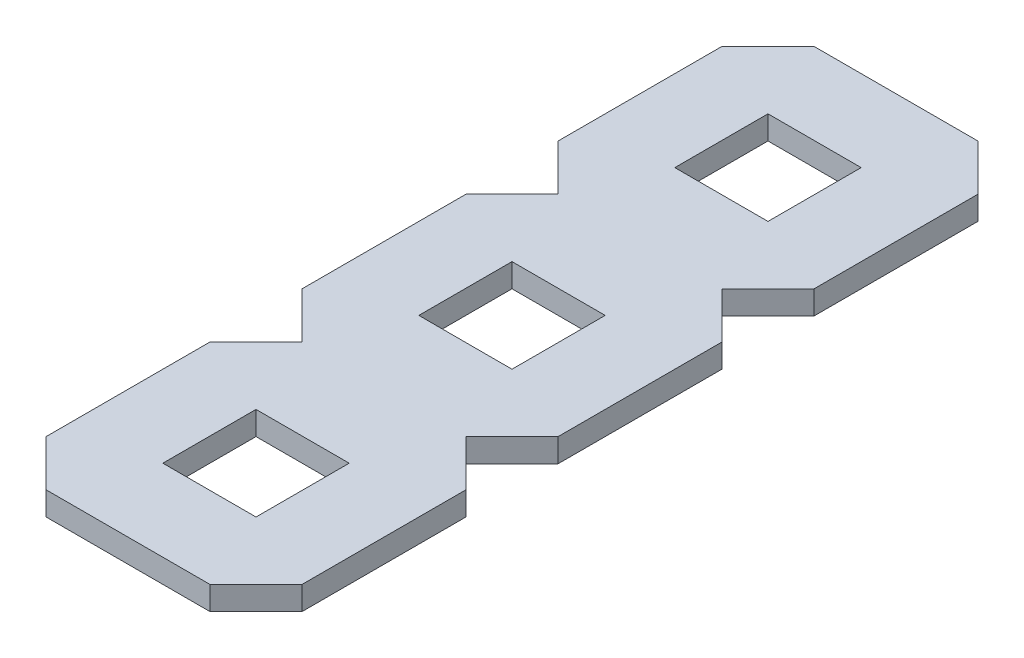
from build123d import *

# Parameters (mm, degrees)
SKETCH1_W           = 4.6228
SKETCH1_H           = 4.6228
BOSS_EXTRUDE1_DEPTH = 1.1684
SKETCH2_W           = 63.5
SKETCH2_H           = 63.5
CUT_EXTRUDE1_DEPTH  = 2.54
CUT_EXTRUDE2_DEPTH  = 13.97


with BuildPart() as part:
    # Sketch1 → Boss-Extrude1 (new body)
    with BuildSketch(Plane(origin=(0, 1.1684, 0), x_dir=(1, 0, 0), z_dir=(0, 1, 0))):
        Polygon((14.980985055, 127), (12.7, 124.719014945), (10.419014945, 127), (2.280985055, 127), (0, 124.719014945), (0, 116.580985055), (2.280985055, 114.3), (0, 112.019014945), (0, 103.880985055), (2.280985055, 101.6), (0, 99.319014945), (0, 91.180985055), (2.280985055, 88.9), (0, 86.619014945), (0, 78.480985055), (2.280985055, 76.2), (0, 73.919014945), (0, 65.780985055), (2.280985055, 63.5), (0, 61.219014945), (0, 53.080985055), (2.280985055, 50.8), (0, 48.519014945), (0, 40.380985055), (2.280985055, 38.1), (0, 35.819014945), (0, 27.680985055), (2.280985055, 25.4), (0, 23.119014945), (0, 14.980985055), (2.280985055, 12.7), (0, 10.419014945), (0, 2.280985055), (2.280985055, 0), (10.419014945, 0), (12.7, 2.280985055), (14.980985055, 0), (23.119014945, 0), (25.4, 2.280985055), (27.680985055, 0), (35.819014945, 0), (38.1, 2.280985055), (40.380985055, 0), (48.519014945, 0), (50.8, 2.280985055), (53.080985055, 0), (61.219014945, 0), (63.5, 2.280985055), (63.5, 10.419014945), (61.219014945, 12.7), (63.5, 14.980985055), (63.5, 23.119014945), (61.219014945, 25.4), (63.5, 27.680985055), (63.5, 35.819014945), (61.219014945, 38.1), (63.5, 40.380985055), (63.5, 48.519014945), (61.219014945, 50.8), (63.5, 53.080985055), (63.5, 61.219014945), (61.219014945, 63.5), (63.5, 65.780985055), (63.5, 73.919014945), (61.219014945, 76.2), (63.5, 78.480985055), (63.5, 86.619014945), (61.219014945, 88.9), (63.5, 91.180985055), (63.5, 99.319014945), (61.219014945, 101.6), (63.5, 103.880985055), (63.5, 112.019014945), (61.219014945, 114.3), (63.5, 116.580985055), (63.5, 124.719014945), (61.219014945, 127), (53.080985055, 127), (50.8, 124.719014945), (48.519014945, 127), (40.380985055, 127), (38.1, 124.719014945), (35.819014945, 127), (27.680985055, 127), (25.4, 124.719014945), (23.119014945, 127), align=None)
        Polygon((12.7, 112.019014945), (10.419014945, 114.3), (12.7, 116.580985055), (14.980985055, 114.3), align=None, mode=Mode.SUBTRACT)
        Polygon((12.7, 86.619014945), (10.419014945, 88.9), (12.7, 91.180985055), (14.980985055, 88.9), align=None, mode=Mode.SUBTRACT)
        Polygon((12.7, 61.219014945), (10.419014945, 63.5), (12.7, 65.780985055), (14.980985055, 63.5), align=None, mode=Mode.SUBTRACT)
        Polygon((12.7, 35.819014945), (10.419014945, 38.1), (12.7, 40.380985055), (14.980985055, 38.1), align=None, mode=Mode.SUBTRACT)
        Polygon((12.7, 10.419014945), (10.419014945, 12.7), (12.7, 14.980985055), (14.980985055, 12.7), align=None, mode=Mode.SUBTRACT)
        Polygon((25.4, 112.019014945), (23.119014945, 114.3), (25.4, 116.580985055), (27.680985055, 114.3), align=None, mode=Mode.SUBTRACT)
        Polygon((25.4, 86.619014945), (23.119014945, 88.9), (25.4, 91.180985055), (27.680985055, 88.9), align=None, mode=Mode.SUBTRACT)
        Polygon((25.4, 61.219014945), (23.119014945, 63.5), (25.4, 65.780985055), (27.680985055, 63.5), align=None, mode=Mode.SUBTRACT)
        Polygon((25.4, 35.819014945), (23.119014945, 38.1), (25.4, 40.380985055), (27.680985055, 38.1), align=None, mode=Mode.SUBTRACT)
        Polygon((25.4, 10.419014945), (23.119014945, 12.7), (25.4, 14.980985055), (27.680985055, 12.7), align=None, mode=Mode.SUBTRACT)
        Polygon((38.1, 112.019014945), (35.819014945, 114.3), (38.1, 116.580985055), (40.380985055, 114.3), align=None, mode=Mode.SUBTRACT)
        Polygon((38.1, 86.619014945), (35.819014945, 88.9), (38.1, 91.180985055), (40.380985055, 88.9), align=None, mode=Mode.SUBTRACT)
        Polygon((38.1, 61.219014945), (35.819014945, 63.5), (38.1, 65.780985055), (40.380985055, 63.5), align=None, mode=Mode.SUBTRACT)
        Polygon((38.1, 35.819014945), (35.819014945, 38.1), (38.1, 40.380985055), (40.380985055, 38.1), align=None, mode=Mode.SUBTRACT)
        Polygon((38.1, 10.419014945), (35.819014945, 12.7), (38.1, 14.980985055), (40.380985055, 12.7), align=None, mode=Mode.SUBTRACT)
        Polygon((50.8, 112.019014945), (48.519014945, 114.3), (50.8, 116.580985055), (53.080985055, 114.3), align=None, mode=Mode.SUBTRACT)
        Polygon((50.8, 86.619014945), (48.519014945, 88.9), (50.8, 91.180985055), (53.080985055, 88.9), align=None, mode=Mode.SUBTRACT)
        Polygon((50.8, 61.219014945), (48.519014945, 63.5), (50.8, 65.780985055), (53.080985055, 63.5), align=None, mode=Mode.SUBTRACT)
        Polygon((50.8, 35.819014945), (48.519014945, 38.1), (50.8, 40.380985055), (53.080985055, 38.1), align=None, mode=Mode.SUBTRACT)
        Polygon((50.8, 10.419014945), (48.519014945, 12.7), (50.8, 14.980985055), (53.080985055, 12.7), align=None, mode=Mode.SUBTRACT)
        with Locations((6.35, 120.65)):
            Rectangle(SKETCH1_W, SKETCH1_H, mode=Mode.SUBTRACT)
        with Locations((19.05, 120.65)):
            Rectangle(SKETCH1_W, SKETCH1_H, mode=Mode.SUBTRACT)
        with Locations((31.75, 120.65)):
            Rectangle(SKETCH1_W, SKETCH1_H, mode=Mode.SUBTRACT)
        with Locations((44.45, 120.65)):
            Rectangle(SKETCH1_W, SKETCH1_H, mode=Mode.SUBTRACT)
        with Locations((57.15, 120.65)):
            Rectangle(SKETCH1_W, SKETCH1_H, mode=Mode.SUBTRACT)
        with Locations((6.35, 107.95)):
            Rectangle(SKETCH1_W, SKETCH1_H, mode=Mode.SUBTRACT)
        with Locations((57.15, 107.95)):
            Rectangle(SKETCH1_W, SKETCH1_H, mode=Mode.SUBTRACT)
        with Locations((6.35, 95.25)):
            Rectangle(SKETCH1_W, SKETCH1_H, mode=Mode.SUBTRACT)
        with Locations((57.15, 95.25)):
            Rectangle(SKETCH1_W, SKETCH1_H, mode=Mode.SUBTRACT)
        with Locations((6.35, 82.55)):
            Rectangle(SKETCH1_W, SKETCH1_H, mode=Mode.SUBTRACT)
        with Locations((57.15, 82.55)):
            Rectangle(SKETCH1_W, SKETCH1_H, mode=Mode.SUBTRACT)
        with Locations((6.35, 69.85)):
            Rectangle(SKETCH1_W, SKETCH1_H, mode=Mode.SUBTRACT)
        with Locations((57.15, 69.85)):
            Rectangle(SKETCH1_W, SKETCH1_H, mode=Mode.SUBTRACT)
        with Locations((6.35, 57.15)):
            Rectangle(SKETCH1_W, SKETCH1_H, mode=Mode.SUBTRACT)
        with Locations((57.15, 57.15)):
            Rectangle(SKETCH1_W, SKETCH1_H, mode=Mode.SUBTRACT)
        with Locations((6.35, 44.45)):
            Rectangle(SKETCH1_W, SKETCH1_H, mode=Mode.SUBTRACT)
        with Locations((57.15, 44.45)):
            Rectangle(SKETCH1_W, SKETCH1_H, mode=Mode.SUBTRACT)
        with Locations((6.35, 31.75)):
            Rectangle(SKETCH1_W, SKETCH1_H, mode=Mode.SUBTRACT)
        with Locations((57.15, 31.75)):
            Rectangle(SKETCH1_W, SKETCH1_H, mode=Mode.SUBTRACT)
        with Locations((6.35, 19.05)):
            Rectangle(SKETCH1_W, SKETCH1_H, mode=Mode.SUBTRACT)
        with Locations((57.15, 19.05)):
            Rectangle(SKETCH1_W, SKETCH1_H, mode=Mode.SUBTRACT)
        with Locations((6.35, 6.35)):
            Rectangle(SKETCH1_W, SKETCH1_H, mode=Mode.SUBTRACT)
        with Locations((19.05, 6.35)):
            Rectangle(SKETCH1_W, SKETCH1_H, mode=Mode.SUBTRACT)
        with Locations((31.75, 6.35)):
            Rectangle(SKETCH1_W, SKETCH1_H, mode=Mode.SUBTRACT)
        with Locations((19.05, 107.95)):
            Rectangle(SKETCH1_W, SKETCH1_H, mode=Mode.SUBTRACT)
        with Locations((31.75, 107.95)):
            Rectangle(SKETCH1_W, SKETCH1_H, mode=Mode.SUBTRACT)
        with Locations((44.45, 107.95)):
            Rectangle(SKETCH1_W, SKETCH1_H, mode=Mode.SUBTRACT)
        with Locations((19.05, 95.25)):
            Rectangle(SKETCH1_W, SKETCH1_H, mode=Mode.SUBTRACT)
        with Locations((31.75, 95.25)):
            Rectangle(SKETCH1_W, SKETCH1_H, mode=Mode.SUBTRACT)
        with Locations((44.45, 95.25)):
            Rectangle(SKETCH1_W, SKETCH1_H, mode=Mode.SUBTRACT)
        with Locations((19.05, 82.55)):
            Rectangle(SKETCH1_W, SKETCH1_H, mode=Mode.SUBTRACT)
        with Locations((31.75, 82.55)):
            Rectangle(SKETCH1_W, SKETCH1_H, mode=Mode.SUBTRACT)
        with Locations((44.45, 82.55)):
            Rectangle(SKETCH1_W, SKETCH1_H, mode=Mode.SUBTRACT)
        with Locations((19.05, 69.85)):
            Rectangle(SKETCH1_W, SKETCH1_H, mode=Mode.SUBTRACT)
        with Locations((31.75, 69.85)):
            Rectangle(SKETCH1_W, SKETCH1_H, mode=Mode.SUBTRACT)
        with Locations((44.45, 69.85)):
            Rectangle(SKETCH1_W, SKETCH1_H, mode=Mode.SUBTRACT)
        with Locations((19.05, 57.15)):
            Rectangle(SKETCH1_W, SKETCH1_H, mode=Mode.SUBTRACT)
        with Locations((31.75, 57.15)):
            Rectangle(SKETCH1_W, SKETCH1_H, mode=Mode.SUBTRACT)
        with Locations((44.45, 57.15)):
            Rectangle(SKETCH1_W, SKETCH1_H, mode=Mode.SUBTRACT)
        with Locations((19.05, 44.45)):
            Rectangle(SKETCH1_W, SKETCH1_H, mode=Mode.SUBTRACT)
        with Locations((31.75, 44.45)):
            Rectangle(SKETCH1_W, SKETCH1_H, mode=Mode.SUBTRACT)
        with Locations((44.45, 44.45)):
            Rectangle(SKETCH1_W, SKETCH1_H, mode=Mode.SUBTRACT)
        with Locations((19.05, 31.75)):
            Rectangle(SKETCH1_W, SKETCH1_H, mode=Mode.SUBTRACT)
        with Locations((31.75, 31.75)):
            Rectangle(SKETCH1_W, SKETCH1_H, mode=Mode.SUBTRACT)
        with Locations((44.45, 31.75)):
            Rectangle(SKETCH1_W, SKETCH1_H, mode=Mode.SUBTRACT)
        with Locations((19.05, 19.05)):
            Rectangle(SKETCH1_W, SKETCH1_H, mode=Mode.SUBTRACT)
        with Locations((31.75, 19.05)):
            Rectangle(SKETCH1_W, SKETCH1_H, mode=Mode.SUBTRACT)
        with Locations((57.15, 6.35)):
            Rectangle(SKETCH1_W, SKETCH1_H, mode=Mode.SUBTRACT)
        with Locations((44.45, 19.05)):
            Rectangle(SKETCH1_W, SKETCH1_H, mode=Mode.SUBTRACT)
        with Locations((44.45, 6.35)):
            Rectangle(SKETCH1_W, SKETCH1_H, mode=Mode.SUBTRACT)
        Polygon((50.8, 23.119014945), (48.519014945, 25.4), (50.8, 27.680985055), (53.080985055, 25.4), align=None, mode=Mode.SUBTRACT)
        Polygon((50.8, 48.519014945), (48.519014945, 50.8), (50.8, 53.080985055), (53.080985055, 50.8), align=None, mode=Mode.SUBTRACT)
        Polygon((50.8, 73.919014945), (48.519014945, 76.2), (50.8, 78.480985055), (53.080985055, 76.2), align=None, mode=Mode.SUBTRACT)
        Polygon((50.8, 99.319014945), (48.519014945, 101.6), (50.8, 103.880985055), (53.080985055, 101.6), align=None, mode=Mode.SUBTRACT)
        Polygon((38.1, 23.119014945), (35.819014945, 25.4), (38.1, 27.680985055), (40.380985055, 25.4), align=None, mode=Mode.SUBTRACT)
        Polygon((38.1, 48.519014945), (35.819014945, 50.8), (38.1, 53.080985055), (40.380985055, 50.8), align=None, mode=Mode.SUBTRACT)
        Polygon((38.1, 73.919014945), (35.819014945, 76.2), (38.1, 78.480985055), (40.380985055, 76.2), align=None, mode=Mode.SUBTRACT)
        Polygon((38.1, 99.319014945), (35.819014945, 101.6), (38.1, 103.880985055), (40.380985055, 101.6), align=None, mode=Mode.SUBTRACT)
        Polygon((25.4, 23.119014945), (23.119014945, 25.4), (25.4, 27.680985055), (27.680985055, 25.4), align=None, mode=Mode.SUBTRACT)
        Polygon((25.4, 48.519014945), (23.119014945, 50.8), (25.4, 53.080985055), (27.680985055, 50.8), align=None, mode=Mode.SUBTRACT)
        Polygon((25.4, 73.919014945), (23.119014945, 76.2), (25.4, 78.480985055), (27.680985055, 76.2), align=None, mode=Mode.SUBTRACT)
        Polygon((25.4, 99.319014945), (23.119014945, 101.6), (25.4, 103.880985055), (27.680985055, 101.6), align=None, mode=Mode.SUBTRACT)
        Polygon((12.7, 23.119014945), (10.419014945, 25.4), (12.7, 27.680985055), (14.980985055, 25.4), align=None, mode=Mode.SUBTRACT)
        Polygon((12.7, 48.519014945), (10.419014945, 50.8), (12.7, 53.080985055), (14.980985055, 50.8), align=None, mode=Mode.SUBTRACT)
        Polygon((12.7, 73.919014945), (10.419014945, 76.2), (12.7, 78.480985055), (14.980985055, 76.2), align=None, mode=Mode.SUBTRACT)
        Polygon((12.7, 99.319014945), (10.419014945, 101.6), (12.7, 103.880985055), (14.980985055, 101.6), align=None, mode=Mode.SUBTRACT)
    extrude(amount=-BOSS_EXTRUDE1_DEPTH)

    # Sketch2 → Cut-Extrude1 (cut)
    with BuildSketch(Plane(origin=(0, 1.1684, 0), x_dir=(1, 0, 0), z_dir=(0, 1, 0))):
        with Locations((31.75, 95.25)):
            Rectangle(SKETCH2_W, SKETCH2_H)
    extrude(amount=-CUT_EXTRUDE1_DEPTH, mode=Mode.SUBTRACT)

    # Sketch3 → Cut-Extrude2 (cut)
    with BuildSketch(Plane(origin=(0, 1.1684, 0), x_dir=(1, 0, 0), z_dir=(0, 1, 0))):
        Polygon((12.7, 65.780985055), (69.718112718, 65.780985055), (69.718112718, -2.022975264), (12.7, -2.022975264), (-3.929855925, -2.022975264), (-3.929855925, 25.4), (12.7, 25.4), align=None)
    extrude(amount=-CUT_EXTRUDE2_DEPTH, mode=Mode.SUBTRACT)


solid = part.part
